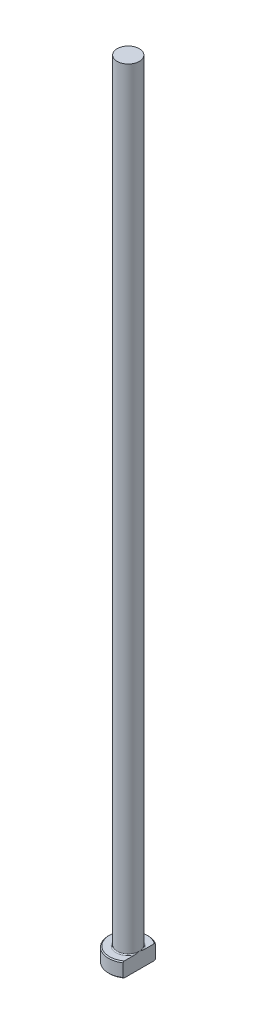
ISO-10303-21;
HEADER;
FILE_DESCRIPTION(('STEP AP214'),'2;1');
FILE_NAME('part.step','',(''),(''),'','','');
FILE_SCHEMA(('AUTOMOTIVE_DESIGN { 1 0 10303 214 1 1 1 1 }'));
ENDSEC;
DATA;
#1=APPLICATION_CONTEXT('core data for automotive mechanical design processes');
#2=APPLICATION_PROTOCOL_DEFINITION('international standard','automotive_design',2000,#1);
#3=PRODUCT_CONTEXT('',#1,'mechanical');
#4=PRODUCT('Part','Part','',(#3));
#5=PRODUCT_RELATED_PRODUCT_CATEGORY('part','',(#4));
#6=PRODUCT_DEFINITION_FORMATION('','',#4);
#7=PRODUCT_DEFINITION_CONTEXT('part definition',#1,'design');
#8=PRODUCT_DEFINITION('design','',#6,#7);
#9=PRODUCT_DEFINITION_SHAPE('','',#8);
#10=(LENGTH_UNIT() NAMED_UNIT(*) SI_UNIT(.MILLI.,.METRE.));
#11=(NAMED_UNIT(*) PLANE_ANGLE_UNIT() SI_UNIT($,.RADIAN.));
#12=(NAMED_UNIT(*) SI_UNIT($,.STERADIAN.) SOLID_ANGLE_UNIT());
#13=UNCERTAINTY_MEASURE_WITH_UNIT(LENGTH_MEASURE(1.E-05),#10,'distance_accuracy_value','');
#14=(GEOMETRIC_REPRESENTATION_CONTEXT(3) GLOBAL_UNCERTAINTY_ASSIGNED_CONTEXT((#13)) GLOBAL_UNIT_ASSIGNED_CONTEXT((#10,
#11,#12)) REPRESENTATION_CONTEXT('',''));
#15=CARTESIAN_POINT('',(0.,0.,0.));
#16=DIRECTION('',(0.,0.,1.));
#17=DIRECTION('',(1.,0.,0.));
#18=AXIS2_PLACEMENT_3D('',#15,#16,#17);
#19=CARTESIAN_POINT('',(0.,0.,0.));
#20=DIRECTION('',(0.,-1.,0.));
#21=DIRECTION('',(0.,0.,-1.));
#22=AXIS2_PLACEMENT_3D('',#19,#20,#21);
#23=PLANE('',#22);
#24=CARTESIAN_POINT('',(0.,0.,0.));
#25=DIRECTION('',(0.,-1.,0.));
#26=DIRECTION('',(0.,0.,-1.));
#27=AXIS2_PLACEMENT_3D('',#24,#25,#26);
#28=CIRCLE('',#27,3.80000000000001);
#29=CARTESIAN_POINT('',(2.24999999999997,0.,3.06227039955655));
#30=VERTEX_POINT('',#29);
#31=CARTESIAN_POINT('',(2.24999999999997,0.,-3.06227039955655));
#32=VERTEX_POINT('',#31);
#33=EDGE_CURVE('E98',#30,#32,#28,.T.);
#34=ORIENTED_EDGE('',*,*,#33,.T.);
#35=DIRECTION('',(0.,0.,1.));
#36=VECTOR('',#35,1.);
#37=CARTESIAN_POINT('',(2.24999999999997,0.,-3.30718913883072));
#38=LINE('',#37,#36);
#39=EDGE_CURVE('E83',#32,#30,#38,.T.);
#40=ORIENTED_EDGE('',*,*,#39,.T.);
#41=EDGE_LOOP('',(#34,#40));
#42=FACE_BOUND('',#41,.T.);
#43=ADVANCED_FACE('F32',(#42),#23,.T.);
#44=CARTESIAN_POINT('',(0.,259.958771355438,0.));
#45=DIRECTION('',(0.,1.,0.));
#46=DIRECTION('',(0.,0.,1.));
#47=AXIS2_PLACEMENT_3D('',#44,#45,#46);
#48=CYLINDRICAL_SURFACE('',#47,3.99999999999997);
#49=CARTESIAN_POINT('',(0.,2.79999999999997,0.));
#50=DIRECTION('',(0.,1.,0.));
#51=DIRECTION('',(0.,0.,1.));
#52=AXIS2_PLACEMENT_3D('',#49,#50,#51);
#53=CIRCLE('',#52,3.99999999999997);
#54=CARTESIAN_POINT('',(2.24999999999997,2.79999999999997,3.30718913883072));
#55=VERTEX_POINT('',#54);
#56=CARTESIAN_POINT('',(2.24999999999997,2.79999999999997,-3.30718913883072));
#57=VERTEX_POINT('',#56);
#58=EDGE_CURVE('E104',#55,#57,#53,.F.);
#59=ORIENTED_EDGE('',*,*,#58,.T.);
#60=DIRECTION('',(0.,-1.,0.));
#61=VECTOR('',#60,1.);
#62=CARTESIAN_POINT('',(2.24999999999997,160.,-3.30718913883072));
#63=LINE('',#62,#61);
#64=CARTESIAN_POINT('',(2.24999999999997,0.199999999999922,-3.30718913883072));
#65=VERTEX_POINT('',#64);
#66=EDGE_CURVE('E183',#57,#65,#63,.T.);
#67=ORIENTED_EDGE('',*,*,#66,.T.);
#68=CARTESIAN_POINT('',(0.,0.199999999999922,0.));
#69=DIRECTION('',(0.,-1.,0.));
#70=DIRECTION('',(0.,0.,-1.));
#71=AXIS2_PLACEMENT_3D('',#68,#69,#70);
#72=CIRCLE('',#71,3.99999999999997);
#73=CARTESIAN_POINT('',(2.24999999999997,0.199999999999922,3.30718913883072));
#74=VERTEX_POINT('',#73);
#75=EDGE_CURVE('E100',#65,#74,#72,.F.);
#76=ORIENTED_EDGE('',*,*,#75,.T.);
#77=DIRECTION('',(0.,-1.,0.));
#78=VECTOR('',#77,1.);
#79=CARTESIAN_POINT('',(2.24999999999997,160.,3.30718913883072));
#80=LINE('',#79,#78);
#81=EDGE_CURVE('E93',#55,#74,#80,.T.);
#82=ORIENTED_EDGE('',*,*,#81,.F.);
#83=EDGE_LOOP('',(#59,#67,#76,#82));
#84=FACE_BOUND('',#83,.T.);
#85=ADVANCED_FACE('F158',(#84),#48,.T.);
#86=CARTESIAN_POINT('',(-3.99999999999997,3.,0.));
#87=DIRECTION('',(0.,1.,0.));
#88=DIRECTION('',(0.,0.,1.));
#89=AXIS2_PLACEMENT_3D('',#86,#87,#88);
#90=PLANE('',#89);
#91=CARTESIAN_POINT('',(0.,3.,0.));
#92=DIRECTION('',(0.,1.,0.));
#93=DIRECTION('',(0.,0.,1.));
#94=AXIS2_PLACEMENT_3D('',#91,#92,#93);
#95=CIRCLE('',#94,3.79999999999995);
#96=CARTESIAN_POINT('',(2.24999999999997,3.,-3.06227039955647));
#97=VERTEX_POINT('',#96);
#98=CARTESIAN_POINT('',(2.24999999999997,3.,3.06227039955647));
#99=VERTEX_POINT('',#98);
#100=EDGE_CURVE('E178',#97,#99,#95,.T.);
#101=ORIENTED_EDGE('',*,*,#100,.T.);
#102=DIRECTION('',(0.,0.,-1.));
#103=VECTOR('',#102,1.);
#104=CARTESIAN_POINT('',(2.24999999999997,3.,0.));
#105=LINE('',#104,#103);
#106=CARTESIAN_POINT('',(2.24999999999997,2.99999999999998,0.969535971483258));
#107=VERTEX_POINT('',#106);
#108=EDGE_CURVE('E57',#99,#107,#105,.T.);
#109=ORIENTED_EDGE('',*,*,#108,.T.);
#110=CARTESIAN_POINT('',(0.,3.,0.));
#111=DIRECTION('',(0.,1.,0.));
#112=DIRECTION('',(0.,0.,1.));
#113=AXIS2_PLACEMENT_3D('',#110,#111,#112);
#114=CIRCLE('',#113,2.44999999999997);
#115=CARTESIAN_POINT('',(2.24999999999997,2.99999999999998,-0.969535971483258));
#116=VERTEX_POINT('',#115);
#117=EDGE_CURVE('E107',#107,#116,#114,.F.);
#118=ORIENTED_EDGE('',*,*,#117,.T.);
#119=EDGE_CURVE('E136',#116,#97,#105,.T.);
#120=ORIENTED_EDGE('',*,*,#119,.T.);
#121=EDGE_LOOP('',(#101,#109,#118,#120));
#122=FACE_BOUND('',#121,.T.);
#123=ADVANCED_FACE('F147',(#122),#90,.T.);
#124=CARTESIAN_POINT('',(0.,3.,0.));
#125=DIRECTION('',(0.,-1.,0.));
#126=DIRECTION('',(0.,0.,-1.));
#127=AXIS2_PLACEMENT_3D('',#124,#125,#126);
#128=CONICAL_SURFACE('',#127,3.79999999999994,0.785398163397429);
#129=ORIENTED_EDGE('',*,*,#58,.F.);
#130=CARTESIAN_POINT('',(2.24999999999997,-0.817697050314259,7.27782992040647));
#131=CARTESIAN_POINT('',(2.24999999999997,-0.691332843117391,7.14556140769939));
#132=CARTESIAN_POINT('',(2.24999999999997,-0.56512225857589,7.01314597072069));
#133=CARTESIAN_POINT('',(2.24999999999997,-0.313071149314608,6.74796170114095));
#134=CARTESIAN_POINT('',(2.24999999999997,-0.187230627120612,6.61519286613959));
#135=CARTESIAN_POINT('',(2.24999999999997,0.189705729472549,6.21619905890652));
#136=CARTESIAN_POINT('',(2.24999999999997,0.440149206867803,5.94935693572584));
#137=CARTESIAN_POINT('',(2.24999999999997,0.940260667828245,5.41146981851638));
#138=CARTESIAN_POINT('',(2.24999999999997,1.18991116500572,5.14040850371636));
#139=CARTESIAN_POINT('',(2.24999999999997,1.56140055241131,4.7311368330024));
#140=CARTESIAN_POINT('',(2.24999999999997,1.68472451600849,4.59427552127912));
#141=CARTESIAN_POINT('',(2.24999999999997,1.9300940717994,4.31941326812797));
#142=CARTESIAN_POINT('',(2.24999999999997,2.05213967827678,4.18141233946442));
#143=CARTESIAN_POINT('',(2.24999999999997,2.31419582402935,3.88150807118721));
#144=CARTESIAN_POINT('',(2.24999999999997,2.45391708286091,3.71935099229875));
#145=CARTESIAN_POINT('',(2.24999999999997,2.73025215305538,3.39234412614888));
#146=CARTESIAN_POINT('',(2.24999999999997,2.86686529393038,3.22749377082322));
#147=CARTESIAN_POINT('',(2.24999999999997,3.13534139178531,2.8943084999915));
#148=CARTESIAN_POINT('',(2.24999999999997,3.26721073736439,2.72597879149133));
#149=CARTESIAN_POINT('',(2.24999999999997,3.45966785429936,2.46950762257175));
#150=CARTESIAN_POINT('',(2.24999999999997,3.52291962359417,2.3833682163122));
#151=CARTESIAN_POINT('',(2.24999999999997,3.64714184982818,2.20946418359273));
#152=CARTESIAN_POINT('',(2.24999999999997,3.70811252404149,2.12169971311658));
#153=CARTESIAN_POINT('',(2.24999999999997,3.82102230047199,1.95327886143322));
#154=CARTESIAN_POINT('',(2.24999999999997,3.8732469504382,1.87281476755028));
#155=CARTESIAN_POINT('',(2.24999999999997,3.97467249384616,1.70998172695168));
#156=CARTESIAN_POINT('',(2.24999999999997,4.02387305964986,1.62761257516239));
#157=CARTESIAN_POINT('',(2.24999999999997,4.11837607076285,1.46059799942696));
#158=CARTESIAN_POINT('',(2.24999999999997,4.16367708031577,1.3759517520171));
#159=CARTESIAN_POINT('',(2.24999999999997,4.24914050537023,1.20413766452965));
#160=CARTESIAN_POINT('',(2.24999999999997,4.28930406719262,1.11697039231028));
#161=CARTESIAN_POINT('',(2.24999999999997,4.38314726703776,0.891175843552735));
#162=CARTESIAN_POINT('',(2.24999999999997,4.43219749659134,0.750488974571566));
#163=CARTESIAN_POINT('',(2.24999999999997,4.48826674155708,0.535159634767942));
#164=CARTESIAN_POINT('',(2.24999999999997,4.50402844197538,0.462776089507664));
#165=CARTESIAN_POINT('',(2.24999999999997,4.5289338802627,0.316860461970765));
#166=CARTESIAN_POINT('',(2.24999999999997,4.53807847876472,0.243328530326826));
#167=CARTESIAN_POINT('',(2.24999999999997,4.54922474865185,0.0949504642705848));
#168=CARTESIAN_POINT('',(2.24999999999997,4.55115152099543,0.020098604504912));
#169=CARTESIAN_POINT('',(2.24999999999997,4.54752076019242,-0.129420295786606));
#170=CARTESIAN_POINT('',(2.24999999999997,4.54196316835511,-0.204087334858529));
#171=CARTESIAN_POINT('',(2.24999999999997,4.5237232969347,-0.352688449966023));
#172=CARTESIAN_POINT('',(2.24999999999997,4.51102617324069,-0.426620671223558));
#173=CARTESIAN_POINT('',(2.24999999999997,4.47926333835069,-0.573094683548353));
#174=CARTESIAN_POINT('',(2.24999999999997,4.46019612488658,-0.645636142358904));
#175=CARTESIAN_POINT('',(2.24999999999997,4.40610994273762,-0.823701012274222));
#176=CARTESIAN_POINT('',(2.24999999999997,4.36783449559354,-0.928230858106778));
#177=CARTESIAN_POINT('',(2.24999999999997,4.28232692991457,-1.13354070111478));
#178=CARTESIAN_POINT('',(2.24999999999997,4.23508812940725,-1.23431783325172));
#179=CARTESIAN_POINT('',(2.24999999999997,4.13380125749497,-1.43298762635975));
#180=CARTESIAN_POINT('',(2.24999999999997,4.07972026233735,-1.53086330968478));
#181=CARTESIAN_POINT('',(2.24999999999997,3.99496203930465,-1.67548648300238));
#182=CARTESIAN_POINT('',(2.24999999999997,3.96610811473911,-1.72332162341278));
#183=CARTESIAN_POINT('',(2.24999999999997,3.90734436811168,-1.81833709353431));
#184=CARTESIAN_POINT('',(2.24999999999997,3.87743458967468,-1.86551745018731));
#185=CARTESIAN_POINT('',(2.24999999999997,3.77509597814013,-2.02354622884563));
#186=CARTESIAN_POINT('',(2.24999999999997,3.70057106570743,-2.13303820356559));
#187=CARTESIAN_POINT('',(2.24999999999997,3.547846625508,-2.34943854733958));
#188=CARTESIAN_POINT('',(2.24999999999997,3.46964624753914,-2.45634630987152));
#189=CARTESIAN_POINT('',(2.24999999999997,3.31046802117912,-2.66818697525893));
#190=CARTESIAN_POINT('',(2.24999999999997,3.22948822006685,-2.7731184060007));
#191=CARTESIAN_POINT('',(2.24999999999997,3.06545223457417,-2.98134898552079));
#192=CARTESIAN_POINT('',(2.24999999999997,2.98239592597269,-3.08464803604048));
#193=CARTESIAN_POINT('',(2.24999999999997,2.73044258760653,-3.39308007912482));
#194=CARTESIAN_POINT('',(2.24999999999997,2.55914389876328,-3.59624854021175));
#195=CARTESIAN_POINT('',(2.24999999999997,2.21260420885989,-3.99901521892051));
#196=CARTESIAN_POINT('',(2.24999999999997,2.03736490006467,-4.19861490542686));
#197=CARTESIAN_POINT('',(2.24999999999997,1.68403823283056,-4.59551245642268));
#198=CARTESIAN_POINT('',(2.24999999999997,1.50594904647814,-4.79280869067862));
#199=CARTESIAN_POINT('',(2.24999999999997,1.14782580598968,-5.18566037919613));
#200=CARTESIAN_POINT('',(2.24999999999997,0.96779155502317,-5.38121565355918));
#201=CARTESIAN_POINT('',(2.24999999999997,0.606519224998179,-5.77078870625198));
#202=CARTESIAN_POINT('',(2.24999999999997,0.425282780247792,-5.96480800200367));
#203=CARTESIAN_POINT('',(2.24999999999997,0.0617463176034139,-6.35184762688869));
#204=CARTESIAN_POINT('',(2.24999999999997,-0.12055370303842,-6.54486795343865));
#205=CARTESIAN_POINT('',(2.24999999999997,-0.388876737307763,-6.82775668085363));
#206=CARTESIAN_POINT('',(2.24999999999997,-0.474578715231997,-6.91792994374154));
#207=CARTESIAN_POINT('',(2.24999999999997,-0.646062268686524,-7.09803491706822));
#208=CARTESIAN_POINT('',(2.24999999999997,-0.73184368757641,-7.18796677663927));
#209=CARTESIAN_POINT('',(2.24999999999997,-0.817697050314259,-7.27782992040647));
#210=B_SPLINE_CURVE_WITH_KNOTS('',3,(#130,#131,#132,#133,#134,#135,#136,#137,#138,#139,#140,
#141,#142,#143,#144,#145,#146,#147,#148,#149,#150,#151,#152,#153,#154,#155,#156,#157,#158,#159,
#160,#161,#162,#163,#164,#165,#166,#167,#168,#169,#170,#171,#172,#173,#174,#175,#176,#177,#178,
#179,#180,#181,#182,#183,#184,#185,#186,#187,#188,#189,#190,#191,#192,#193,#194,#195,#196,#197,
#198,#199,#200,#201,#202,#203,#204,#205,#206,#207,#208,#209),.UNSPECIFIED.,.F.,.F.,(4,2,2,2,2,2,
2,2,2,2,2,2,2,2,2,2,2,2,2,2,2,2,2,2,2,2,2,2,2,2,2,2,2,2,2,2,2,2,2,4),(0.,0.548785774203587,
1.09757528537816,2.19544562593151,3.30094607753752,3.85362276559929,4.40629327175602,
5.04841012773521,5.69066421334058,6.33201824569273,6.65259523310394,6.97314160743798,
7.26086761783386,7.54862474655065,7.83648737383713,8.12428565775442,8.56956070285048,
8.79154735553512,9.01350513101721,9.23775987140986,9.46201637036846,9.68674086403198,
9.91151839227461,10.2448678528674,10.5784668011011,10.9137368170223,11.0813178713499,
11.2488920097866,11.6461164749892,12.0434332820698,12.4410351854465,12.8386609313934,
13.6357991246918,14.43260129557,15.2299368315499,16.0273538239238,16.8238479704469,
17.6203441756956,17.9935523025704,18.3664002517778),.UNSPECIFIED.);
#211=EDGE_CURVE('E135',#55,#99,#210,.T.);
#212=ORIENTED_EDGE('',*,*,#211,.T.);
#213=ORIENTED_EDGE('',*,*,#100,.F.);
#214=EDGE_CURVE('E127',#97,#57,#210,.T.);
#215=ORIENTED_EDGE('',*,*,#214,.T.);
#216=EDGE_LOOP('',(#129,#212,#213,#215));
#217=FACE_BOUND('',#216,.T.);
#218=ADVANCED_FACE('F143',(#217),#128,.T.);
#219=CARTESIAN_POINT('',(0.,0.199999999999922,0.));
#220=DIRECTION('',(0.,1.,0.));
#221=DIRECTION('',(0.,0.,1.));
#222=AXIS2_PLACEMENT_3D('',#219,#220,#221);
#223=CONICAL_SURFACE('',#222,3.99999999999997,0.785398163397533);
#224=ORIENTED_EDGE('',*,*,#75,.F.);
#225=CARTESIAN_POINT('',(2.24999999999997,3.8176970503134,-7.27782992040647));
#226=CARTESIAN_POINT('',(2.24999999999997,3.69133284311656,-7.14556140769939));
#227=CARTESIAN_POINT('',(2.24999999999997,3.56512225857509,-7.01314597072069));
#228=CARTESIAN_POINT('',(2.24999999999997,3.31307114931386,-6.74796170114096));
#229=CARTESIAN_POINT('',(2.24999999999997,3.18723062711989,-6.6151928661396));
#230=CARTESIAN_POINT('',(2.24999999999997,2.81029427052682,-6.21619905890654));
#231=CARTESIAN_POINT('',(2.24999999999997,2.55985079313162,-5.94935693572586));
#232=CARTESIAN_POINT('',(2.24999999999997,2.05973933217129,-5.41146981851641));
#233=CARTESIAN_POINT('',(2.24999999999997,1.81008883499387,-5.14040850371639));
#234=CARTESIAN_POINT('',(2.24999999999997,1.43859944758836,-4.73113683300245));
#235=CARTESIAN_POINT('',(2.24999999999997,1.31527548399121,-4.59427552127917));
#236=CARTESIAN_POINT('',(2.24999999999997,1.06990592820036,-4.31941326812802));
#237=CARTESIAN_POINT('',(2.24999999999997,0.947860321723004,-4.18141233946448));
#238=CARTESIAN_POINT('',(2.24999999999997,0.685804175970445,-3.88150807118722));
#239=CARTESIAN_POINT('',(2.24999999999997,0.546082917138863,-3.7193509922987));
#240=CARTESIAN_POINT('',(2.24999999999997,0.269747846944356,-3.39234412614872));
#241=CARTESIAN_POINT('',(2.24999999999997,0.133134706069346,-3.227493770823));
#242=CARTESIAN_POINT('',(2.24999999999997,-0.135341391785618,-2.89430849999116));
#243=CARTESIAN_POINT('',(2.24999999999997,-0.267210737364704,-2.72597879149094));
#244=CARTESIAN_POINT('',(2.24999999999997,-0.459667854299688,-2.46950762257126));
#245=CARTESIAN_POINT('',(2.24999999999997,-0.522919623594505,-2.38336821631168));
#246=CARTESIAN_POINT('',(2.24999999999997,-0.647141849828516,-2.20946418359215));
#247=CARTESIAN_POINT('',(2.24999999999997,-0.708112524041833,-2.12169971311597));
#248=CARTESIAN_POINT('',(2.24999999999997,-0.821022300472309,-1.95327886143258));
#249=CARTESIAN_POINT('',(2.24999999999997,-0.873246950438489,-1.87281476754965));
#250=CARTESIAN_POINT('',(2.24999999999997,-0.974672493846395,-1.70998172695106));
#251=CARTESIAN_POINT('',(2.24999999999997,-1.02387305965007,-1.62761257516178));
#252=CARTESIAN_POINT('',(2.24999999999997,-1.11837607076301,-1.46059799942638));
#253=CARTESIAN_POINT('',(2.24999999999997,-1.1636770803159,-1.37595175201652));
#254=CARTESIAN_POINT('',(2.24999999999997,-1.24914050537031,-1.20413766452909));
#255=CARTESIAN_POINT('',(2.24999999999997,-1.28930406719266,-1.11697039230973));
#256=CARTESIAN_POINT('',(2.24999999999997,-1.38314726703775,-0.891175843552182));
#257=CARTESIAN_POINT('',(2.24999999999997,-1.43219749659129,-0.750488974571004));
#258=CARTESIAN_POINT('',(2.24999999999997,-1.48826674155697,-0.535159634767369));
#259=CARTESIAN_POINT('',(2.24999999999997,-1.50402844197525,-0.462776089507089));
#260=CARTESIAN_POINT('',(2.24999999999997,-1.52893388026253,-0.316860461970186));
#261=CARTESIAN_POINT('',(2.24999999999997,-1.53807847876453,-0.243328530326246));
#262=CARTESIAN_POINT('',(2.24999999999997,-1.54922474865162,-0.0949504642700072));
#263=CARTESIAN_POINT('',(2.24999999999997,-1.55115152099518,-0.0200986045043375));
#264=CARTESIAN_POINT('',(2.24999999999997,-1.54752076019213,0.129420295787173));
#265=CARTESIAN_POINT('',(2.24999999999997,-1.5419631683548,0.204087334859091));
#266=CARTESIAN_POINT('',(2.24999999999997,-1.52372329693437,0.352688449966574));
#267=CARTESIAN_POINT('',(2.24999999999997,-1.51102617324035,0.426620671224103));
#268=CARTESIAN_POINT('',(2.24999999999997,-1.47926333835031,0.573094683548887));
#269=CARTESIAN_POINT('',(2.24999999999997,-1.4601961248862,0.645636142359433));
#270=CARTESIAN_POINT('',(2.24999999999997,-1.40610994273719,0.823701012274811));
#271=CARTESIAN_POINT('',(2.24999999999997,-1.36783449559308,0.92823085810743));
#272=CARTESIAN_POINT('',(2.24999999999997,-1.28232692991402,1.13354070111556));
#273=CARTESIAN_POINT('',(2.24999999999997,-1.23508812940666,1.23431783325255));
#274=CARTESIAN_POINT('',(2.24999999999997,-1.1338012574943,1.4329876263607));
#275=CARTESIAN_POINT('',(2.24999999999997,-1.07972026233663,1.53086330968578));
#276=CARTESIAN_POINT('',(2.24999999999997,-0.994962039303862,1.67548648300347));
#277=CARTESIAN_POINT('',(2.24999999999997,-0.966108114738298,1.7233216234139));
#278=CARTESIAN_POINT('',(2.24999999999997,-0.907344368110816,1.81833709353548));
#279=CARTESIAN_POINT('',(2.24999999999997,-0.877434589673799,1.86551745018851));
#280=CARTESIAN_POINT('',(2.24999999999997,-0.775095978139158,2.02354622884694));
#281=CARTESIAN_POINT('',(2.24999999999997,-0.700571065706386,2.13303820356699));
#282=CARTESIAN_POINT('',(2.24999999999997,-0.547846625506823,2.34943854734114));
#283=CARTESIAN_POINT('',(2.24999999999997,-0.469646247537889,2.45634630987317));
#284=CARTESIAN_POINT('',(2.24999999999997,-0.310468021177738,2.66818697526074));
#285=CARTESIAN_POINT('',(2.24999999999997,-0.229488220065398,2.77311840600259));
#286=CARTESIAN_POINT('',(2.24999999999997,-0.0654522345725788,2.98134898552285));
#287=CARTESIAN_POINT('',(2.24999999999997,0.01760407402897,3.08464803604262));
#288=CARTESIAN_POINT('',(2.24999999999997,0.269557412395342,3.39308007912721));
#289=CARTESIAN_POINT('',(2.24999999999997,0.440856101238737,3.59624854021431));
#290=CARTESIAN_POINT('',(2.24999999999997,0.787395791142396,3.9990152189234));
#291=CARTESIAN_POINT('',(2.24999999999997,0.962635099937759,4.19861490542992));
#292=CARTESIAN_POINT('',(2.24999999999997,1.31596176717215,4.59551245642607));
#293=CARTESIAN_POINT('',(2.24999999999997,1.49405095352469,4.79280869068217));
#294=CARTESIAN_POINT('',(2.24999999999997,1.85217419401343,5.18566037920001));
#295=CARTESIAN_POINT('',(2.24999999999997,2.03220844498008,5.38121565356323));
#296=CARTESIAN_POINT('',(2.24999999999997,2.39348077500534,5.77078870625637));
#297=CARTESIAN_POINT('',(2.24999999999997,2.57471721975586,5.96480800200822));
#298=CARTESIAN_POINT('',(2.24999999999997,2.93825368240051,6.35184762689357));
#299=CARTESIAN_POINT('',(2.24999999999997,3.12055370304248,6.5448679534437));
#300=CARTESIAN_POINT('',(2.24999999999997,3.38887673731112,6.82775668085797));
#301=CARTESIAN_POINT('',(2.24999999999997,3.47457871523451,6.917929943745));
#302=CARTESIAN_POINT('',(2.24999999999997,3.64606226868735,7.09803491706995));
#303=CARTESIAN_POINT('',(2.24999999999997,3.73184368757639,7.18796677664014));
#304=CARTESIAN_POINT('',(2.24999999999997,3.8176970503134,7.27782992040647));
#305=B_SPLINE_CURVE_WITH_KNOTS('',3,(#225,#226,#227,#228,#229,#230,#231,#232,#233,#234,#235,
#236,#237,#238,#239,#240,#241,#242,#243,#244,#245,#246,#247,#248,#249,#250,#251,#252,#253,#254,
#255,#256,#257,#258,#259,#260,#261,#262,#263,#264,#265,#266,#267,#268,#269,#270,#271,#272,#273,
#274,#275,#276,#277,#278,#279,#280,#281,#282,#283,#284,#285,#286,#287,#288,#289,#290,#291,#292,
#293,#294,#295,#296,#297,#298,#299,#300,#301,#302,#303,#304),.UNSPECIFIED.,.F.,.F.,(4,2,2,2,2,2,
2,2,2,2,2,2,2,2,2,2,2,2,2,2,2,2,2,2,2,2,2,2,2,2,2,2,2,2,2,2,2,2,2,4),(0.,0.548785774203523,
1.09757528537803,2.19544562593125,3.30094607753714,3.85362276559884,4.40629327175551,
5.04841012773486,5.69066421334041,6.33201824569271,6.65259523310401,6.97314160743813,
7.26086761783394,7.54862474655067,7.83648737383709,8.12428565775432,8.56956070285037,
8.791547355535,9.01350513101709,9.23775987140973,9.46201637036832,9.68674086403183,
9.91151839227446,10.2448678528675,10.5784668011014,10.9137368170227,11.0813178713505,
11.2488920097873,11.6461164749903,12.0434332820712,12.4410351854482,12.8386609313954,
13.6357991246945,14.4326012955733,15.2299368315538,16.0273538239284,16.8238479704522,
17.6203441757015,17.9935523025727,18.3664002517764),.UNSPECIFIED.);
#306=EDGE_CURVE('E86',#65,#32,#305,.T.);
#307=ORIENTED_EDGE('',*,*,#306,.T.);
#308=ORIENTED_EDGE('',*,*,#33,.F.);
#309=EDGE_CURVE('E89',#30,#74,#305,.T.);
#310=ORIENTED_EDGE('',*,*,#309,.T.);
#311=EDGE_LOOP('',(#224,#307,#308,#310));
#312=FACE_BOUND('',#311,.T.);
#313=ADVANCED_FACE('F97',(#312),#223,.T.);
#314=CARTESIAN_POINT('',(0.,3.19999999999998,0.));
#315=DIRECTION('',(0.,1.,0.));
#316=DIRECTION('',(0.,0.,1.));
#317=AXIS2_PLACEMENT_3D('',#314,#315,#316);
#318=TOROIDAL_SURFACE('',#317,2.44999999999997,0.2);
#319=CARTESIAN_POINT('',(2.24999999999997,3.19999999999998,0.));
#320=CARTESIAN_POINT('',(2.24999999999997,3.20000050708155,6.44726104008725E-11));
#321=CARTESIAN_POINT('',(2.24999999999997,3.20000101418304,-1.58891186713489E-07));
#322=CARTESIAN_POINT('',(2.24999999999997,3.20000197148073,-6.21779236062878E-07));
#323=CARTESIAN_POINT('',(2.24999999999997,3.20000241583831,-9.34460755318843E-07));
#324=CARTESIAN_POINT('',(2.24999999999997,3.20000332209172,-1.68105190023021E-06));
#325=CARTESIAN_POINT('',(2.24999999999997,3.20000377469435,-2.12646372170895E-06));
#326=CARTESIAN_POINT('',(2.24999999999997,3.20000460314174,-3.06333876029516E-06));
#327=CARTESIAN_POINT('',(2.24999999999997,3.2000049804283,-3.55360517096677E-06));
#328=CARTESIAN_POINT('',(2.24999999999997,3.20000633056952,-5.39956008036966E-06));
#329=CARTESIAN_POINT('',(2.24999999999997,3.20000722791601,-6.81237619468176E-06));
#330=CARTESIAN_POINT('',(2.24999999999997,3.20000875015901,-9.65315882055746E-06));
#331=CARTESIAN_POINT('',(2.24999999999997,3.2000093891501,-1.10739426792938E-05));
#332=CARTESIAN_POINT('',(2.24999999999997,3.20001197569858,-1.69289386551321E-05));
#333=CARTESIAN_POINT('',(2.24999999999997,3.20001384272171,-2.14029807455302E-05));
#334=CARTESIAN_POINT('',(2.24999999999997,3.20001668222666,-2.99701699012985E-05));
#335=CARTESIAN_POINT('',(2.24999999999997,3.20001774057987,-3.40349906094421E-05));
#336=CARTESIAN_POINT('',(2.24999999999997,3.20002529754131,-6.37611258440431E-05));
#337=CARTESIAN_POINT('',(2.24999999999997,3.20003087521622,-8.96095284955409E-05));
#338=CARTESIAN_POINT('',(2.24999999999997,3.20005527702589,-0.00019117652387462));
#339=CARTESIAN_POINT('',(2.24999999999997,3.20007870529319,-0.000265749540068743));
#340=CARTESIAN_POINT('',(2.24999999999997,3.2001693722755,-0.000559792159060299));
#341=CARTESIAN_POINT('',(2.24999999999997,3.20023350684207,-0.000779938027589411));
#342=CARTESIAN_POINT('',(2.24999999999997,3.20048920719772,-0.00165050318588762));
#343=CARTESIAN_POINT('',(2.24999999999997,3.20068459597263,-0.00230007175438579));
#344=CARTESIAN_POINT('',(2.24999999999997,3.20149322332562,-0.00499620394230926));
#345=CARTESIAN_POINT('',(2.24999999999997,3.20210170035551,-0.00704382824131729));
#346=CARTESIAN_POINT('',(2.24999999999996,3.2079710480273,-0.0267853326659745));
#347=CARTESIAN_POINT('',(2.24999999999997,3.21325284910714,-0.0444747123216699));
#348=CARTESIAN_POINT('',(2.24999999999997,3.22356918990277,-0.0791736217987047));
#349=CARTESIAN_POINT('',(2.24999999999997,3.22860532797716,-0.0961827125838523));
#350=CARTESIAN_POINT('',(2.24999999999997,3.23925368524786,-0.132326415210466));
#351=CARTESIAN_POINT('',(2.24999999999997,3.24485983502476,-0.151462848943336));
#352=CARTESIAN_POINT('',(2.24999999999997,3.25603662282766,-0.189968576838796));
#353=CARTESIAN_POINT('',(2.24999999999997,3.26160623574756,-0.209338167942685));
#354=CARTESIAN_POINT('',(2.24999999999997,3.27500311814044,-0.256523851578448));
#355=CARTESIAN_POINT('',(2.24999999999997,3.28276182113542,-0.284359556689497));
#356=CARTESIAN_POINT('',(2.24999999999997,3.29771346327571,-0.339425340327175));
#357=CARTESIAN_POINT('',(2.24999999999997,3.30491576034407,-0.36665287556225));
#358=CARTESIAN_POINT('',(2.24999999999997,3.32240345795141,-0.435090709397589));
#359=CARTESIAN_POINT('',(2.24999999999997,3.33239618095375,-0.476377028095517));
#360=CARTESIAN_POINT('',(2.24999999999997,3.35100390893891,-0.559624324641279));
#361=CARTESIAN_POINT('',(2.24999999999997,3.3596067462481,-0.601588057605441));
#362=CARTESIAN_POINT('',(2.24999999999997,3.37543235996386,-0.689258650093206));
#363=CARTESIAN_POINT('',(2.24999999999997,3.38248971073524,-0.73499643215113));
#364=CARTESIAN_POINT('',(2.24999999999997,3.39342529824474,-0.826730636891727));
#365=CARTESIAN_POINT('',(2.24999999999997,3.39731270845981,-0.872725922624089));
#366=CARTESIAN_POINT('',(2.24999999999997,3.40071499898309,-0.963783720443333));
#367=CARTESIAN_POINT('',(2.24999999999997,3.40033773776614,-1.00884048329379));
#368=CARTESIAN_POINT('',(2.24999999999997,3.39535803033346,-1.07577565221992));
#369=CARTESIAN_POINT('',(2.24999999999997,3.39299580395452,-1.09781842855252));
#370=CARTESIAN_POINT('',(2.24999999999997,3.38649339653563,-1.14163100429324));
#371=CARTESIAN_POINT('',(2.24999999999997,3.38235512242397,-1.16340107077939));
#372=CARTESIAN_POINT('',(2.24999999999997,3.37178290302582,-1.20664751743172));
#373=CARTESIAN_POINT('',(2.24999999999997,3.36532376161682,-1.2281178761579));
#374=CARTESIAN_POINT('',(2.24999999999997,3.34940253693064,-1.26994619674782));
#375=CARTESIAN_POINT('',(2.24999999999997,3.33994859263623,-1.29030700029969));
#376=CARTESIAN_POINT('',(2.24999999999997,3.32341167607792,-1.3178414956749));
#377=CARTESIAN_POINT('',(2.24999999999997,3.31797729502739,-1.32600125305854));
#378=CARTESIAN_POINT('',(2.24999999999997,3.30618383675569,-1.34165219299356));
#379=CARTESIAN_POINT('',(2.24999999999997,3.29982370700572,-1.34914259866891));
#380=CARTESIAN_POINT('',(2.24999999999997,3.28597385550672,-1.36322511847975));
#381=CARTESIAN_POINT('',(2.24999999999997,3.27846961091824,-1.36980324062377));
#382=CARTESIAN_POINT('',(2.24999999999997,3.26235014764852,-1.3814177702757));
#383=CARTESIAN_POINT('',(2.24999999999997,3.25373945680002,-1.38646019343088));
#384=CARTESIAN_POINT('',(2.24999999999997,3.23893119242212,-1.39291408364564));
#385=CARTESIAN_POINT('',(2.24999999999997,3.23301804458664,-1.39497873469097));
#386=CARTESIAN_POINT('',(2.24999999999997,3.22092968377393,-1.3980973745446));
#387=CARTESIAN_POINT('',(2.24999999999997,3.21475469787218,-1.39915222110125));
#388=CARTESIAN_POINT('',(2.24999999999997,3.20229305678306,-1.4001597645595));
#389=CARTESIAN_POINT('',(2.24999999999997,3.19600609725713,-1.40010876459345));
#390=CARTESIAN_POINT('',(2.24999999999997,3.18353929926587,-1.39890051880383));
#391=CARTESIAN_POINT('',(2.24999999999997,3.17735949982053,-1.39774287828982));
#392=CARTESIAN_POINT('',(2.24999999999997,3.16550896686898,-1.39448677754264));
#393=CARTESIAN_POINT('',(2.24999999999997,3.15982782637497,-1.39242539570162));
#394=CARTESIAN_POINT('',(2.24999999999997,3.14882191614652,-1.38751374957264));
#395=CARTESIAN_POINT('',(2.24999999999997,3.14349727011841,-1.38466321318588));
#396=CARTESIAN_POINT('',(2.24999999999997,3.13026923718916,-1.37647479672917));
#397=CARTESIAN_POINT('',(2.24999999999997,3.12266499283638,-1.37065399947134));
#398=CARTESIAN_POINT('',(2.24999999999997,3.10845647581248,-1.35789458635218));
#399=CARTESIAN_POINT('',(2.24999999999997,3.10185542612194,-1.3509525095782));
#400=CARTESIAN_POINT('',(2.24999999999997,3.0855320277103,-1.33150080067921));
#401=CARTESIAN_POINT('',(2.24999999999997,3.07660573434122,-1.31832816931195));
#402=CARTESIAN_POINT('',(2.24999999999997,3.06078136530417,-1.29086374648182));
#403=CARTESIAN_POINT('',(2.24999999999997,3.05388481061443,-1.27657112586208));
#404=CARTESIAN_POINT('',(2.24999999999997,3.03602738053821,-1.23377116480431));
#405=CARTESIAN_POINT('',(2.24999999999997,3.02722778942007,-1.20437236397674));
#406=CARTESIAN_POINT('',(2.24999999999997,3.01362163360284,-1.14441037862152));
#407=CARTESIAN_POINT('',(2.24999999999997,3.00886464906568,-1.11383741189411));
#408=CARTESIAN_POINT('',(2.24999999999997,3.00105881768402,-1.03966563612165));
#409=CARTESIAN_POINT('',(2.24999999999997,2.99953171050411,-0.995912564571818));
#410=CARTESIAN_POINT('',(2.24999999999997,3.00070174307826,-0.908367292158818));
#411=CARTESIAN_POINT('',(2.24999999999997,3.00341475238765,-0.86457556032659));
#412=CARTESIAN_POINT('',(2.24999999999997,3.01171554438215,-0.779778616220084));
#413=CARTESIAN_POINT('',(2.24999999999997,3.01713219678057,-0.738755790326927));
#414=CARTESIAN_POINT('',(2.24999999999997,3.03001638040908,-0.657360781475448));
#415=CARTESIAN_POINT('',(2.24999999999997,3.03746816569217,-0.616986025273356));
#416=CARTESIAN_POINT('',(2.24999999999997,3.05405724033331,-0.535981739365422));
#417=CARTESIAN_POINT('',(2.24999999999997,3.06321733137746,-0.495356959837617));
#418=CARTESIAN_POINT('',(2.24999999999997,3.0829739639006,-0.413374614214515));
#419=CARTESIAN_POINT('',(2.24999999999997,3.09360096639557,-0.372024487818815));
#420=CARTESIAN_POINT('',(2.24999999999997,3.11230155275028,-0.302306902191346));
#421=CARTESIAN_POINT('',(2.24999999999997,3.12014883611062,-0.273877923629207));
#422=CARTESIAN_POINT('',(2.24999999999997,3.13605900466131,-0.217411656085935));
#423=CARTESIAN_POINT('',(2.24999999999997,3.14411864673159,-0.189373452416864));
#424=CARTESIAN_POINT('',(2.24999999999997,3.15951571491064,-0.136466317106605));
#425=CARTESIAN_POINT('',(2.24999999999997,3.1668337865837,-0.111591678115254));
#426=CARTESIAN_POINT('',(2.24999999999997,3.18187191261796,-0.0608432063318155));
#427=CARTESIAN_POINT('',(2.24999999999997,3.18959608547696,-0.0349705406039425));
#428=CARTESIAN_POINT('',(2.24999999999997,3.19789887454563,-0.00704171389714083));
#429=CARTESIAN_POINT('',(2.24999999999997,3.19850801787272,-0.00499199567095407));
#430=CARTESIAN_POINT('',(2.24999999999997,3.19931680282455,-0.0022953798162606));
#431=CARTESIAN_POINT('',(2.24999999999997,3.19951170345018,-0.00164742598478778));
#432=CARTESIAN_POINT('',(2.24999999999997,3.19976680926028,-0.000778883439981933));
#433=CARTESIAN_POINT('',(2.24999999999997,3.19983082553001,-0.00055914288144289));
#434=CARTESIAN_POINT('',(2.24999999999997,3.19992134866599,-0.000265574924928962));
#435=CARTESIAN_POINT('',(2.24999999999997,3.19994475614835,-0.00019107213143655));
#436=CARTESIAN_POINT('',(2.24999999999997,3.19996913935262,-8.95867306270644E-05));
#437=CARTESIAN_POINT('',(2.24999999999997,3.19997471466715,-6.37485903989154E-05));
#438=CARTESIAN_POINT('',(2.24999999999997,3.1999822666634,-3.40328341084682E-05));
#439=CARTESIAN_POINT('',(2.24999999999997,3.19998332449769,-2.9968622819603E-05));
#440=CARTESIAN_POINT('',(2.24999999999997,3.19998616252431,-2.14026473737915E-05));
#441=CARTESIAN_POINT('',(2.24999999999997,3.19998802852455,-1.69291778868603E-05));
#442=CARTESIAN_POINT('',(2.24999999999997,3.19999061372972,-1.10747627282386E-05));
#443=CARTESIAN_POINT('',(2.24999999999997,3.19999125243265,-9.654024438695E-06));
#444=CARTESIAN_POINT('',(2.24999999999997,3.19999277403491,-6.81328215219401E-06));
#445=CARTESIAN_POINT('',(2.24999999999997,3.19999367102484,-5.40045583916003E-06));
#446=CARTESIAN_POINT('',(2.24999999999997,3.19999502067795,-3.55442702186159E-06));
#447=CARTESIAN_POINT('',(2.24999999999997,3.19999539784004,-3.06412583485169E-06));
#448=CARTESIAN_POINT('',(2.24999999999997,3.19999622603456,-2.12715879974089E-06));
#449=CARTESIAN_POINT('',(2.24999999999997,3.19999667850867,-1.68168917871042E-06));
#450=CARTESIAN_POINT('',(2.24999999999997,3.19999758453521,-9.34960575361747E-07));
#451=CARTESIAN_POINT('',(2.24999999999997,3.19999802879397,-6.22203836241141E-07));
#452=CARTESIAN_POINT('',(2.24999999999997,3.1999989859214,-1.59128804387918E-07));
#453=CARTESIAN_POINT('',(2.24999999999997,3.19999949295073,-6.44685022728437E-11));
#454=CARTESIAN_POINT('',(2.24999999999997,3.19999999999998,0.));
#455=B_SPLINE_CURVE_WITH_KNOTS('',3,(#319,#320,#321,#322,#323,#324,#325,#326,#327,#328,#329,
#330,#331,#332,#333,#334,#335,#336,#337,#338,#339,#340,#341,#342,#343,#344,#345,#346,#347,#348,
#349,#350,#351,#352,#353,#354,#355,#356,#357,#358,#359,#360,#361,#362,#363,#364,#365,#366,#367,
#368,#369,#370,#371,#372,#373,#374,#375,#376,#377,#378,#379,#380,#381,#382,#383,#384,#385,#386,
#387,#388,#389,#390,#391,#392,#393,#394,#395,#396,#397,#398,#399,#400,#401,#402,#403,#404,#405,
#406,#407,#408,#409,#410,#411,#412,#413,#414,#415,#416,#417,#418,#419,#420,#421,#422,#423,#424,
#425,#426,#427,#428,#429,#430,#431,#432,#433,#434,#435,#436,#437,#438,#439,#440,#441,#442,#443,
#444,#445,#446,#447,#448,#449,#450,#451,#452,#453,#454),.UNSPECIFIED.,.T.,.F.,(4,2,2,2,2,2,2,2,
2,2,2,2,2,2,2,2,2,2,2,2,2,2,2,2,2,2,2,2,2,2,2,2,2,2,2,2,2,2,2,2,2,2,2,2,2,2,2,2,2,2,2,2,2,2,2,2,
2,2,2,2,2,2,2,2,2,2,2,4),(0.,1.52660891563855E-06,3.1524133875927E-06,5.04759848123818E-06,
6.90201355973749E-06,1.19024884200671E-05,1.65722258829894E-05,3.10841862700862E-05,
4.36688554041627E-05,0.000123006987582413,0.000357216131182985,0.00104540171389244,
0.00308000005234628,0.00948876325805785,0.0648698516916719,0.118087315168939,0.17790910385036,
0.238372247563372,0.325060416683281,0.40955017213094,0.536965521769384,0.665442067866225,
0.804194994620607,0.942544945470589,1.07740386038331,1.14385780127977,1.21024056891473,
1.27736693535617,1.34431241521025,1.37367425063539,1.40306973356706,1.43287536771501,
1.46256269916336,1.48127715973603,1.49997570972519,1.51873677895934,1.53750454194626,
1.55556541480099,1.57363252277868,1.60219661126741,1.63085061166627,1.67831692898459,
1.72581872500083,1.81736829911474,1.91002510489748,2.04102939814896,2.17252517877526,
2.29658958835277,2.41972004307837,2.54462990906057,2.67269769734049,2.76117244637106,
2.84869182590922,2.92647873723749,3.00747864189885,3.01389398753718,3.01592352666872,
3.016610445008,3.0168444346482,3.01692374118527,3.01693632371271,3.01695083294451,
3.01695550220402,3.01696050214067,3.01696235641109,3.01696425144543,3.01696587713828,
3.01696740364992),.UNSPECIFIED.);
#456=CARTESIAN_POINT('',(2.24999999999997,3.19999999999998,0.));
#457=VERTEX_POINT('',#456);
#458=EDGE_CURVE('E11',#116,#457,#455,.T.);
#459=ORIENTED_EDGE('',*,*,#458,.F.);
#460=ORIENTED_EDGE('',*,*,#117,.F.);
#461=CARTESIAN_POINT('',(2.24999999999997,3.19999999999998,0.));
#462=CARTESIAN_POINT('',(2.24999999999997,3.19999949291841,-6.44726152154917E-11));
#463=CARTESIAN_POINT('',(2.24999999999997,3.19999898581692,1.58891186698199E-07));
#464=CARTESIAN_POINT('',(2.24999999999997,3.19999802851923,6.21779236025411E-07));
#465=CARTESIAN_POINT('',(2.24999999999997,3.19999758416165,9.34460755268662E-07));
#466=CARTESIAN_POINT('',(2.24999999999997,3.19999667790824,1.68105190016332E-06));
#467=CARTESIAN_POINT('',(2.24999999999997,3.19999622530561,2.12646372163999E-06));
#468=CARTESIAN_POINT('',(2.24999999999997,3.19999539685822,3.06333876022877E-06));
#469=CARTESIAN_POINT('',(2.24999999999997,3.19999501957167,3.55360517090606E-06));
#470=CARTESIAN_POINT('',(2.24999999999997,3.19999366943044,5.39956008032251E-06));
#471=CARTESIAN_POINT('',(2.24999999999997,3.19999277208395,6.81237619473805E-06));
#472=CARTESIAN_POINT('',(2.24999999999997,3.19999124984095,9.65315882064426E-06));
#473=CARTESIAN_POINT('',(2.24999999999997,3.19999061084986,1.10739426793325E-05));
#474=CARTESIAN_POINT('',(2.24999999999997,3.19998802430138,1.69289386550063E-05));
#475=CARTESIAN_POINT('',(2.24999999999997,3.19998615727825,2.14029807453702E-05));
#476=CARTESIAN_POINT('',(2.24999999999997,3.1999833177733,2.99701699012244E-05));
#477=CARTESIAN_POINT('',(2.24999999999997,3.19998225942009,3.40349906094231E-05));
#478=CARTESIAN_POINT('',(2.24999999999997,3.19997470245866,6.37611258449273E-05));
#479=CARTESIAN_POINT('',(2.24999999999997,3.19996912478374,8.96095284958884E-05));
#480=CARTESIAN_POINT('',(2.24999999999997,3.19994472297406,0.000191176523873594));
#481=CARTESIAN_POINT('',(2.24999999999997,3.19992129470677,0.00026574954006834));
#482=CARTESIAN_POINT('',(2.24999999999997,3.19983062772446,0.000559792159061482));
#483=CARTESIAN_POINT('',(2.24999999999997,3.19976649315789,0.000779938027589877));
#484=CARTESIAN_POINT('',(2.24999999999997,3.19951079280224,0.00165050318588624));
#485=CARTESIAN_POINT('',(2.24999999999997,3.19931540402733,0.00230007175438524));
#486=CARTESIAN_POINT('',(2.24999999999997,3.19850677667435,0.00499620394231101));
#487=CARTESIAN_POINT('',(2.24999999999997,3.19789829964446,0.00704382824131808));
#488=CARTESIAN_POINT('',(2.24999999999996,3.19202895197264,0.0267853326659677));
#489=CARTESIAN_POINT('',(2.24999999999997,3.18674715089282,0.0444747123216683));
#490=CARTESIAN_POINT('',(2.24999999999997,3.1764308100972,0.0791736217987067));
#491=CARTESIAN_POINT('',(2.24999999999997,3.1713946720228,0.096182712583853));
#492=CARTESIAN_POINT('',(2.24999999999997,3.1607463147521,0.132326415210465));
#493=CARTESIAN_POINT('',(2.24999999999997,3.1551401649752,0.151462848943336));
#494=CARTESIAN_POINT('',(2.24999999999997,3.1439633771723,0.189968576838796));
#495=CARTESIAN_POINT('',(2.24999999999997,3.1383937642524,0.209338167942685));
#496=CARTESIAN_POINT('',(2.24999999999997,3.12499688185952,0.256523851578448));
#497=CARTESIAN_POINT('',(2.24999999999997,3.11723817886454,0.284359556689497));
#498=CARTESIAN_POINT('',(2.24999999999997,3.10228653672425,0.339425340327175));
#499=CARTESIAN_POINT('',(2.24999999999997,3.09508423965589,0.36665287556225));
#500=CARTESIAN_POINT('',(2.24999999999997,3.07759654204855,0.435090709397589));
#501=CARTESIAN_POINT('',(2.24999999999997,3.06760381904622,0.476377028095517));
#502=CARTESIAN_POINT('',(2.24999999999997,3.04899609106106,0.559624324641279));
#503=CARTESIAN_POINT('',(2.24999999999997,3.04039325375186,0.601588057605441));
#504=CARTESIAN_POINT('',(2.24999999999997,3.0245676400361,0.689258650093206));
#505=CARTESIAN_POINT('',(2.24999999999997,3.01751028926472,0.73499643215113));
#506=CARTESIAN_POINT('',(2.24999999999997,3.00657470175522,0.826730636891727));
#507=CARTESIAN_POINT('',(2.24999999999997,3.00268729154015,0.872725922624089));
#508=CARTESIAN_POINT('',(2.24999999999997,2.99928500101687,0.963783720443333));
#509=CARTESIAN_POINT('',(2.24999999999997,2.99966226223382,1.00884048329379));
#510=CARTESIAN_POINT('',(2.24999999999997,3.0046419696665,1.07577565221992));
#511=CARTESIAN_POINT('',(2.24999999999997,3.00700419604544,1.09781842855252));
#512=CARTESIAN_POINT('',(2.24999999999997,3.01350660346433,1.14163100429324));
#513=CARTESIAN_POINT('',(2.24999999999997,3.017644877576,1.16340107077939));
#514=CARTESIAN_POINT('',(2.24999999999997,3.02821709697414,1.20664751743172));
#515=CARTESIAN_POINT('',(2.24999999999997,3.03467623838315,1.2281178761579));
#516=CARTESIAN_POINT('',(2.24999999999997,3.05059746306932,1.26994619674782));
#517=CARTESIAN_POINT('',(2.24999999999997,3.06005140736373,1.29030700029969));
#518=CARTESIAN_POINT('',(2.24999999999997,3.07658832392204,1.3178414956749));
#519=CARTESIAN_POINT('',(2.24999999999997,3.08202270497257,1.32600125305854));
#520=CARTESIAN_POINT('',(2.24999999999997,3.09381616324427,1.34165219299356));
#521=CARTESIAN_POINT('',(2.24999999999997,3.10017629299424,1.34914259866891));
#522=CARTESIAN_POINT('',(2.24999999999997,3.11402614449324,1.36322511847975));
#523=CARTESIAN_POINT('',(2.24999999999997,3.12153038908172,1.36980324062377));
#524=CARTESIAN_POINT('',(2.24999999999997,3.13764985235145,1.3814177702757));
#525=CARTESIAN_POINT('',(2.24999999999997,3.14626054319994,1.38646019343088));
#526=CARTESIAN_POINT('',(2.24999999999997,3.16106880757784,1.39291408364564));
#527=CARTESIAN_POINT('',(2.24999999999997,3.16698195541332,1.39497873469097));
#528=CARTESIAN_POINT('',(2.24999999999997,3.17907031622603,1.3980973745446));
#529=CARTESIAN_POINT('',(2.24999999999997,3.18524530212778,1.39915222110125));
#530=CARTESIAN_POINT('',(2.24999999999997,3.1977069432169,1.4001597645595));
#531=CARTESIAN_POINT('',(2.24999999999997,3.20399390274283,1.40010876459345));
#532=CARTESIAN_POINT('',(2.24999999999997,3.21646070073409,1.39890051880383));
#533=CARTESIAN_POINT('',(2.24999999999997,3.22264050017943,1.39774287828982));
#534=CARTESIAN_POINT('',(2.24999999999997,3.23449103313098,1.39448677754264));
#535=CARTESIAN_POINT('',(2.24999999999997,3.24017217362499,1.39242539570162));
#536=CARTESIAN_POINT('',(2.24999999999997,3.25117808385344,1.38751374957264));
#537=CARTESIAN_POINT('',(2.24999999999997,3.25650272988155,1.38466321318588));
#538=CARTESIAN_POINT('',(2.24999999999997,3.2697307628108,1.37647479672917));
#539=CARTESIAN_POINT('',(2.24999999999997,3.27733500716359,1.37065399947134));
#540=CARTESIAN_POINT('',(2.24999999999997,3.29154352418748,1.35789458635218));
#541=CARTESIAN_POINT('',(2.24999999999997,3.29814457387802,1.3509525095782));
#542=CARTESIAN_POINT('',(2.24999999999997,3.31446797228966,1.33150080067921));
#543=CARTESIAN_POINT('',(2.24999999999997,3.32339426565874,1.31832816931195));
#544=CARTESIAN_POINT('',(2.24999999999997,3.3392186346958,1.29086374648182));
#545=CARTESIAN_POINT('',(2.24999999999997,3.34611518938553,1.27657112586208));
#546=CARTESIAN_POINT('',(2.24999999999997,3.36397261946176,1.23377116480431));
#547=CARTESIAN_POINT('',(2.24999999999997,3.37277221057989,1.20437236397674));
#548=CARTESIAN_POINT('',(2.24999999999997,3.38637836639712,1.14441037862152));
#549=CARTESIAN_POINT('',(2.24999999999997,3.39113535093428,1.11383741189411));
#550=CARTESIAN_POINT('',(2.24999999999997,3.39894118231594,1.03966563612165));
#551=CARTESIAN_POINT('',(2.24999999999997,3.40046828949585,0.995912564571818));
#552=CARTESIAN_POINT('',(2.24999999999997,3.3992982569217,0.908367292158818));
#553=CARTESIAN_POINT('',(2.24999999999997,3.39658524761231,0.86457556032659));
#554=CARTESIAN_POINT('',(2.24999999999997,3.38828445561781,0.779778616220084));
#555=CARTESIAN_POINT('',(2.24999999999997,3.38286780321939,0.738755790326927));
#556=CARTESIAN_POINT('',(2.24999999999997,3.36998361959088,0.657360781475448));
#557=CARTESIAN_POINT('',(2.24999999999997,3.36253183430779,0.616986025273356));
#558=CARTESIAN_POINT('',(2.24999999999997,3.34594275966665,0.535981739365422));
#559=CARTESIAN_POINT('',(2.24999999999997,3.3367826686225,0.495356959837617));
#560=CARTESIAN_POINT('',(2.24999999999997,3.31702603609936,0.413374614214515));
#561=CARTESIAN_POINT('',(2.24999999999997,3.30639903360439,0.372024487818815));
#562=CARTESIAN_POINT('',(2.24999999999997,3.28769844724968,0.302306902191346));
#563=CARTESIAN_POINT('',(2.24999999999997,3.27985116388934,0.273877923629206));
#564=CARTESIAN_POINT('',(2.24999999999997,3.26394099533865,0.217411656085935));
#565=CARTESIAN_POINT('',(2.24999999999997,3.25588135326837,0.189373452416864));
#566=CARTESIAN_POINT('',(2.24999999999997,3.24048428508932,0.136466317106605));
#567=CARTESIAN_POINT('',(2.24999999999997,3.23316621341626,0.111591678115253));
#568=CARTESIAN_POINT('',(2.24999999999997,3.218128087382,0.0608432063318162));
#569=CARTESIAN_POINT('',(2.24999999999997,3.210403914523,0.0349705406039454));
#570=CARTESIAN_POINT('',(2.24999999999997,3.20210112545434,0.00704171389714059));
#571=CARTESIAN_POINT('',(2.24999999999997,3.20149198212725,0.00499199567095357));
#572=CARTESIAN_POINT('',(2.24999999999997,3.20068319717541,0.00229537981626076));
#573=CARTESIAN_POINT('',(2.24999999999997,3.20048829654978,0.00164742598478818));
#574=CARTESIAN_POINT('',(2.24999999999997,3.20023319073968,0.0007788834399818));
#575=CARTESIAN_POINT('',(2.24999999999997,3.20016917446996,0.000559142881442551));
#576=CARTESIAN_POINT('',(2.24999999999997,3.20007865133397,0.000265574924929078));
#577=CARTESIAN_POINT('',(2.24999999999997,3.20005524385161,0.000191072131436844));
#578=CARTESIAN_POINT('',(2.24999999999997,3.20003086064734,8.95867306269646E-05));
#579=CARTESIAN_POINT('',(2.24999999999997,3.20002528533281,6.37485903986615E-05));
#580=CARTESIAN_POINT('',(2.24999999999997,3.20001773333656,3.4032834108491E-05));
#581=CARTESIAN_POINT('',(2.24999999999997,3.20001667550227,2.99686228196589E-05));
#582=CARTESIAN_POINT('',(2.24999999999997,3.20001383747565,2.14026473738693E-05));
#583=CARTESIAN_POINT('',(2.24999999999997,3.20001197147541,1.69291778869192E-05));
#584=CARTESIAN_POINT('',(2.24999999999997,3.20000938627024,1.10747627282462E-05));
#585=CARTESIAN_POINT('',(2.24999999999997,3.20000874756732,9.65402443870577E-06));
#586=CARTESIAN_POINT('',(2.24999999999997,3.20000722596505,6.81328215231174E-06));
#587=CARTESIAN_POINT('',(2.24999999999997,3.20000632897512,5.4004558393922E-06));
#588=CARTESIAN_POINT('',(2.24999999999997,3.20000497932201,3.55442702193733E-06));
#589=CARTESIAN_POINT('',(2.24999999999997,3.20000460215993,3.06412583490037E-06));
#590=CARTESIAN_POINT('',(2.24999999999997,3.2000037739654,2.1271587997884E-06));
#591=CARTESIAN_POINT('',(2.24999999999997,3.2000033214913,1.68168917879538E-06));
#592=CARTESIAN_POINT('',(2.24999999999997,3.20000241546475,9.34960575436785E-07));
#593=CARTESIAN_POINT('',(2.24999999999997,3.20000197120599,6.22203836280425E-07));
#594=CARTESIAN_POINT('',(2.24999999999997,3.20000101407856,1.59128804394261E-07));
#595=CARTESIAN_POINT('',(2.24999999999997,3.20000050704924,6.44685070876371E-11));
#596=CARTESIAN_POINT('',(2.24999999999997,3.19999999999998,0.));
#597=B_SPLINE_CURVE_WITH_KNOTS('',3,(#461,#462,#463,#464,#465,#466,#467,#468,#469,#470,#471,
#472,#473,#474,#475,#476,#477,#478,#479,#480,#481,#482,#483,#484,#485,#486,#487,#488,#489,#490,
#491,#492,#493,#494,#495,#496,#497,#498,#499,#500,#501,#502,#503,#504,#505,#506,#507,#508,#509,
#510,#511,#512,#513,#514,#515,#516,#517,#518,#519,#520,#521,#522,#523,#524,#525,#526,#527,#528,
#529,#530,#531,#532,#533,#534,#535,#536,#537,#538,#539,#540,#541,#542,#543,#544,#545,#546,#547,
#548,#549,#550,#551,#552,#553,#554,#555,#556,#557,#558,#559,#560,#561,#562,#563,#564,#565,#566,
#567,#568,#569,#570,#571,#572,#573,#574,#575,#576,#577,#578,#579,#580,#581,#582,#583,#584,#585,
#586,#587,#588,#589,#590,#591,#592,#593,#594,#595,#596),.UNSPECIFIED.,.T.,.F.,(4,2,2,2,2,2,2,2,
2,2,2,2,2,2,2,2,2,2,2,2,2,2,2,2,2,2,2,2,2,2,2,2,2,2,2,2,2,2,2,2,2,2,2,2,2,2,2,2,2,2,2,2,2,2,2,2,
2,2,2,2,2,2,2,2,2,2,2,4),(0.,1.52660891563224E-06,3.15241338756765E-06,5.04759848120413E-06,
6.90201355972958E-06,1.19024884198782E-05,1.65722258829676E-05,3.1084186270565E-05,
4.36688554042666E-05,0.000123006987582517,0.000357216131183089,0.00104540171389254,
0.00308000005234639,0.00948876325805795,0.0648698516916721,0.11808731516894,0.17790910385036,
0.238372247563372,0.325060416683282,0.40955017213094,0.536965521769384,0.665442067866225,
0.804194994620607,0.942544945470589,1.07740386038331,1.14385780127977,1.21024056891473,
1.27736693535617,1.34431241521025,1.37367425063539,1.40306973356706,1.43287536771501,
1.46256269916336,1.48127715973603,1.49997570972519,1.51873677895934,1.53750454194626,
1.55556541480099,1.57363252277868,1.60219661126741,1.63085061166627,1.67831692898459,
1.72581872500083,1.81736829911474,1.91002510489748,2.04102939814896,2.17252517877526,
2.29658958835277,2.41972004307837,2.54462990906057,2.67269769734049,2.76117244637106,
2.84869182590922,2.9264787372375,3.00747864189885,3.01389398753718,3.01592352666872,
3.016610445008,3.0168444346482,3.01692374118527,3.01693632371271,3.01695083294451,
3.01695550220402,3.01696050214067,3.01696235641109,3.01696425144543,3.01696587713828,
3.01696740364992),.UNSPECIFIED.);
#598=EDGE_CURVE('E46',#457,#107,#597,.T.);
#599=ORIENTED_EDGE('',*,*,#598,.F.);
#600=CARTESIAN_POINT('',(0.,3.19999999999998,0.));
#601=DIRECTION('',(0.,1.,0.));
#602=DIRECTION('',(0.,0.,1.));
#603=AXIS2_PLACEMENT_3D('',#600,#601,#602);
#604=CIRCLE('',#603,2.24999999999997);
#605=EDGE_CURVE('E103',#457,#457,#604,.T.);
#606=ORIENTED_EDGE('',*,*,#605,.F.);
#607=EDGE_LOOP('',(#459,#460,#599,#606));
#608=FACE_BOUND('',#607,.T.);
#609=ADVANCED_FACE('F34',(#608),#318,.F.);
#610=CARTESIAN_POINT('',(0.,259.958771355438,0.));
#611=DIRECTION('',(0.,1.,0.));
#612=DIRECTION('',(0.,0.,1.));
#613=AXIS2_PLACEMENT_3D('',#610,#611,#612);
#614=CYLINDRICAL_SURFACE('',#613,2.24999999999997);
#615=ORIENTED_EDGE('',*,*,#605,.T.);
#616=EDGE_LOOP('',(#615));
#617=FACE_BOUND('',#616,.T.);
#618=CARTESIAN_POINT('',(0.,160.,0.));
#619=DIRECTION('',(0.,1.,0.));
#620=DIRECTION('',(0.,0.,1.));
#621=AXIS2_PLACEMENT_3D('',#618,#619,#620);
#622=CIRCLE('',#621,2.24999999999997);
#623=CARTESIAN_POINT('',(0.,160.,2.24999999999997));
#624=VERTEX_POINT('',#623);
#625=EDGE_CURVE('E101',#624,#624,#622,.T.);
#626=ORIENTED_EDGE('',*,*,#625,.F.);
#627=EDGE_LOOP('',(#626));
#628=FACE_BOUND('',#627,.T.);
#629=ADVANCED_FACE('F155',(#617,#628),#614,.T.);
#630=CARTESIAN_POINT('',(-2.24999999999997,160.,0.));
#631=DIRECTION('',(0.,1.,0.));
#632=DIRECTION('',(0.,0.,1.));
#633=AXIS2_PLACEMENT_3D('',#630,#631,#632);
#634=PLANE('',#633);
#635=ORIENTED_EDGE('',*,*,#625,.T.);
#636=EDGE_LOOP('',(#635));
#637=FACE_BOUND('',#636,.T.);
#638=ADVANCED_FACE('F121',(#637),#634,.T.);
#639=CARTESIAN_POINT('',(2.24999999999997,160.,-3.30718913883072));
#640=DIRECTION('',(1.,0.,0.));
#641=DIRECTION('',(0.,0.,-1.));
#642=AXIS2_PLACEMENT_3D('',#639,#640,#641);
#643=PLANE('',#642);
#644=ORIENTED_EDGE('',*,*,#66,.F.);
#645=ORIENTED_EDGE('',*,*,#214,.F.);
#646=ORIENTED_EDGE('',*,*,#119,.F.);
#647=ORIENTED_EDGE('',*,*,#458,.T.);
#648=ORIENTED_EDGE('',*,*,#598,.T.);
#649=ORIENTED_EDGE('',*,*,#108,.F.);
#650=ORIENTED_EDGE('',*,*,#211,.F.);
#651=ORIENTED_EDGE('',*,*,#81,.T.);
#652=ORIENTED_EDGE('',*,*,#309,.F.);
#653=ORIENTED_EDGE('',*,*,#39,.F.);
#654=ORIENTED_EDGE('',*,*,#306,.F.);
#655=EDGE_LOOP('',(#644,#645,#646,#647,#648,#649,#650,#651,#652,#653,#654));
#656=FACE_BOUND('',#655,.T.);
#657=ADVANCED_FACE('F85',(#656),#643,.T.);
#658=CLOSED_SHELL('',(#43,#85,#123,#218,#313,#609,#629,#638,#657));
#659=MANIFOLD_SOLID_BREP('B2',#658);
#660=ADVANCED_BREP_SHAPE_REPRESENTATION('',(#18,#659),#14);
#661=SHAPE_DEFINITION_REPRESENTATION(#9,#660);
ENDSEC;
END-ISO-10303-21;
